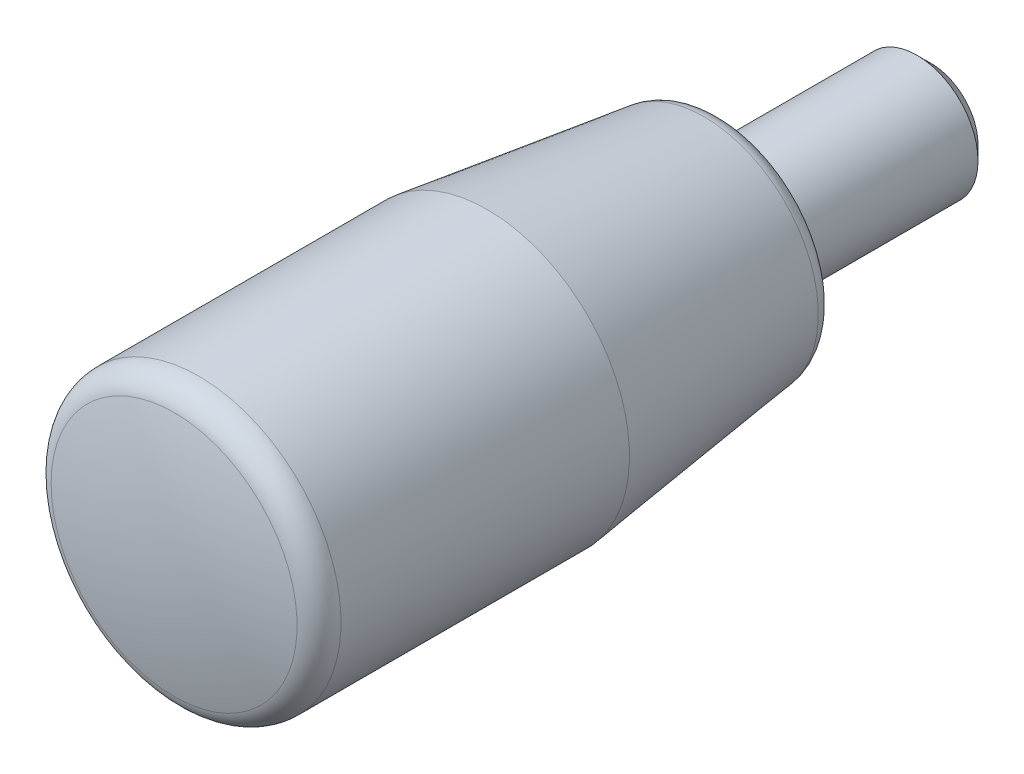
ISO-10303-21;
HEADER;
FILE_DESCRIPTION(('STEP AP214'),'2;1');
FILE_NAME('part.step','',(''),(''),'','','');
FILE_SCHEMA(('AUTOMOTIVE_DESIGN { 1 0 10303 214 1 1 1 1 }'));
ENDSEC;
DATA;
#1=APPLICATION_CONTEXT('core data for automotive mechanical design processes');
#2=APPLICATION_PROTOCOL_DEFINITION('international standard','automotive_design',2000,#1);
#3=PRODUCT_CONTEXT('',#1,'mechanical');
#4=PRODUCT('Part','Part','',(#3));
#5=PRODUCT_RELATED_PRODUCT_CATEGORY('part','',(#4));
#6=PRODUCT_DEFINITION_FORMATION('','',#4);
#7=PRODUCT_DEFINITION_CONTEXT('part definition',#1,'design');
#8=PRODUCT_DEFINITION('design','',#6,#7);
#9=PRODUCT_DEFINITION_SHAPE('','',#8);
#10=(LENGTH_UNIT() NAMED_UNIT(*) SI_UNIT(.MILLI.,.METRE.));
#11=(NAMED_UNIT(*) PLANE_ANGLE_UNIT() SI_UNIT($,.RADIAN.));
#12=(NAMED_UNIT(*) SI_UNIT($,.STERADIAN.) SOLID_ANGLE_UNIT());
#13=UNCERTAINTY_MEASURE_WITH_UNIT(LENGTH_MEASURE(1.E-05),#10,'distance_accuracy_value','');
#14=(GEOMETRIC_REPRESENTATION_CONTEXT(3) GLOBAL_UNCERTAINTY_ASSIGNED_CONTEXT((#13)) GLOBAL_UNIT_ASSIGNED_CONTEXT((#10,
#11,#12)) REPRESENTATION_CONTEXT('',''));
#15=CARTESIAN_POINT('',(0.,0.,0.));
#16=DIRECTION('',(0.,0.,1.));
#17=DIRECTION('',(1.,0.,0.));
#18=AXIS2_PLACEMENT_3D('',#15,#16,#17);
#19=CARTESIAN_POINT('',(0.,0.,1.3));
#20=DIRECTION('',(0.,0.,-1.));
#21=DIRECTION('',(-1.,0.,0.));
#22=AXIS2_PLACEMENT_3D('',#19,#20,#21);
#23=TOROIDAL_SURFACE('',#22,4.62147853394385,1.00000000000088);
#24=CARTESIAN_POINT('',(0.,0.,0.299999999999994));
#25=DIRECTION('',(0.,0.,-1.));
#26=DIRECTION('',(-1.,0.,0.));
#27=AXIS2_PLACEMENT_3D('',#24,#25,#26);
#28=CIRCLE('',#27,4.62147853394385);
#29=CARTESIAN_POINT('',(-4.62147853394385,0.,0.299999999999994));
#30=VERTEX_POINT('',#29);
#31=EDGE_CURVE('E142',#30,#30,#28,.T.);
#32=ORIENTED_EDGE('',*,*,#31,.F.);
#33=EDGE_LOOP('',(#32));
#34=FACE_BOUND('',#33,.T.);
#35=CARTESIAN_POINT('',(0.,0.,1.17120252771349));
#36=DIRECTION('',(0.,0.,-1.));
#37=DIRECTION('',(-1.,0.,0.));
#38=AXIS2_PLACEMENT_3D('',#35,#36,#37);
#39=CIRCLE('',#38,5.61314945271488);
#40=CARTESIAN_POINT('',(-5.61314945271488,0.,1.17120252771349));
#41=VERTEX_POINT('',#40);
#42=EDGE_CURVE('E116',#41,#41,#39,.T.);
#43=ORIENTED_EDGE('',*,*,#42,.T.);
#44=EDGE_LOOP('',(#43));
#45=FACE_BOUND('',#44,.T.);
#46=ADVANCED_FACE('F14',(#34,#45),#23,.T.);
#47=CARTESIAN_POINT('',(0.,4.,0.299999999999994));
#48=DIRECTION('',(0.,0.,-1.));
#49=DIRECTION('',(-1.,0.,0.));
#50=AXIS2_PLACEMENT_3D('',#47,#48,#49);
#51=PLANE('',#50);
#52=ORIENTED_EDGE('',*,*,#31,.T.);
#53=EDGE_LOOP('',(#52));
#54=FACE_BOUND('',#53,.T.);
#55=CARTESIAN_POINT('',(0.,0.,0.299999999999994));
#56=DIRECTION('',(0.,0.,-1.));
#57=DIRECTION('',(-1.,0.,0.));
#58=AXIS2_PLACEMENT_3D('',#55,#56,#57);
#59=CIRCLE('',#58,4.);
#60=CARTESIAN_POINT('',(-4.,0.,0.299999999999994));
#61=VERTEX_POINT('',#60);
#62=EDGE_CURVE('E139',#61,#61,#59,.T.);
#63=ORIENTED_EDGE('',*,*,#62,.F.);
#64=EDGE_LOOP('',(#63));
#65=FACE_BOUND('',#64,.T.);
#66=ADVANCED_FACE('F165',(#54,#65),#51,.T.);
#67=CARTESIAN_POINT('',(0.,0.,-14.7));
#68=DIRECTION('',(0.,0.,-1.));
#69=DIRECTION('',(-1.,0.,0.));
#70=AXIS2_PLACEMENT_3D('',#67,#68,#69);
#71=CYLINDRICAL_SURFACE('',#70,4.);
#72=ORIENTED_EDGE('',*,*,#62,.T.);
#73=EDGE_LOOP('',(#72));
#74=FACE_BOUND('',#73,.T.);
#75=CARTESIAN_POINT('',(0.,0.,0.));
#76=DIRECTION('',(0.,0.,-1.));
#77=DIRECTION('',(-1.,0.,0.));
#78=AXIS2_PLACEMENT_3D('',#75,#76,#77);
#79=CIRCLE('',#78,4.);
#80=CARTESIAN_POINT('',(-4.,0.,0.));
#81=VERTEX_POINT('',#80);
#82=EDGE_CURVE('E136',#81,#81,#79,.T.);
#83=ORIENTED_EDGE('',*,*,#82,.F.);
#84=EDGE_LOOP('',(#83));
#85=FACE_BOUND('',#84,.T.);
#86=ADVANCED_FACE('F171',(#74,#85),#71,.T.);
#87=CARTESIAN_POINT('',(0.,4.,0.));
#88=DIRECTION('',(0.,0.,1.));
#89=DIRECTION('',(1.,0.,0.));
#90=AXIS2_PLACEMENT_3D('',#87,#88,#89);
#91=PLANE('',#90);
#92=CARTESIAN_POINT('',(0.,0.,0.));
#93=DIRECTION('',(0.,0.,-1.));
#94=DIRECTION('',(-1.,0.,0.));
#95=AXIS2_PLACEMENT_3D('',#92,#93,#94);
#96=CIRCLE('',#95,3.);
#97=CARTESIAN_POINT('',(-3.,0.,0.));
#98=VERTEX_POINT('',#97);
#99=EDGE_CURVE('E133',#98,#98,#96,.T.);
#100=ORIENTED_EDGE('',*,*,#99,.F.);
#101=EDGE_LOOP('',(#100));
#102=FACE_BOUND('',#101,.T.);
#103=ORIENTED_EDGE('',*,*,#82,.T.);
#104=EDGE_LOOP('',(#103));
#105=FACE_BOUND('',#104,.T.);
#106=ADVANCED_FACE('F179',(#102,#105),#91,.F.);
#107=CARTESIAN_POINT('',(0.,0.,-14.7));
#108=DIRECTION('',(0.,0.,-1.));
#109=DIRECTION('',(-1.,0.,0.));
#110=AXIS2_PLACEMENT_3D('',#107,#108,#109);
#111=CYLINDRICAL_SURFACE('',#110,3.);
#112=CARTESIAN_POINT('',(0.,0.,-9.3));
#113=DIRECTION('',(0.,0.,1.));
#114=DIRECTION('',(1.,0.,0.));
#115=AXIS2_PLACEMENT_3D('',#112,#113,#114);
#116=CIRCLE('',#115,3.);
#117=CARTESIAN_POINT('',(3.,0.,-9.3));
#118=VERTEX_POINT('',#117);
#119=EDGE_CURVE('E9',#118,#118,#116,.T.);
#120=ORIENTED_EDGE('',*,*,#119,.T.);
#121=EDGE_LOOP('',(#120));
#122=FACE_BOUND('',#121,.T.);
#123=ORIENTED_EDGE('',*,*,#99,.T.);
#124=EDGE_LOOP('',(#123));
#125=FACE_BOUND('',#124,.T.);
#126=ADVANCED_FACE('F183',(#122,#125),#111,.T.);
#127=CARTESIAN_POINT('',(0.,0.,3.));
#128=DIRECTION('',(-1.,0.,0.));
#129=DIRECTION('',(0.,0.,1.));
#130=AXIS2_PLACEMENT_3D('',#127,#128,#129);
#131=SPHERICAL_SURFACE('',#130,25.);
#132=CARTESIAN_POINT('',(0.,0.,3.));
#133=DIRECTION('',(0.,0.,-1.));
#134=DIRECTION('',(-1.,0.,0.));
#135=AXIS2_PLACEMENT_3D('',#132,#133,#134);
#136=SPHERICAL_SURFACE('',#135,25.);
#137=CARTESIAN_POINT('',(0.,0.,27.2562497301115));
#138=DIRECTION('',(0.,0.,-1.));
#139=DIRECTION('',(-1.,0.,0.));
#140=AXIS2_PLACEMENT_3D('',#137,#138,#139);
#141=CIRCLE('',#140,6.05263157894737);
#142=CARTESIAN_POINT('',(-6.05263157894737,0.,27.2562497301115));
#143=VERTEX_POINT('',#142);
#144=EDGE_CURVE('E130',#143,#143,#141,.T.);
#145=ORIENTED_EDGE('',*,*,#144,.F.);
#146=EDGE_LOOP('',(#145));
#147=FACE_BOUND('',#146,.T.);
#148=ADVANCED_FACE('F186',(#147),#136,.T.);
#149=CARTESIAN_POINT('',(0.,0.,26.043437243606));
#150=DIRECTION('',(0.,0.,-1.));
#151=DIRECTION('',(-1.,0.,0.));
#152=AXIS2_PLACEMENT_3D('',#149,#150,#151);
#153=TOROIDAL_SURFACE('',#152,5.75,1.24999999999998);
#154=CARTESIAN_POINT('',(0.,0.,26.043437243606));
#155=DIRECTION('',(0.,0.,-1.));
#156=DIRECTION('',(-1.,0.,0.));
#157=AXIS2_PLACEMENT_3D('',#154,#155,#156);
#158=CIRCLE('',#157,7.);
#159=CARTESIAN_POINT('',(-7.,0.,26.043437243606));
#160=VERTEX_POINT('',#159);
#161=EDGE_CURVE('E127',#160,#160,#158,.T.);
#162=ORIENTED_EDGE('',*,*,#161,.F.);
#163=EDGE_LOOP('',(#162));
#164=FACE_BOUND('',#163,.T.);
#165=ORIENTED_EDGE('',*,*,#144,.T.);
#166=EDGE_LOOP('',(#165));
#167=FACE_BOUND('',#166,.T.);
#168=ADVANCED_FACE('F191',(#164,#167),#153,.T.);
#169=CARTESIAN_POINT('',(0.,0.,-14.7));
#170=DIRECTION('',(0.,0.,-1.));
#171=DIRECTION('',(-1.,0.,0.));
#172=AXIS2_PLACEMENT_3D('',#169,#170,#171);
#173=CYLINDRICAL_SURFACE('',#172,7.);
#174=CARTESIAN_POINT('',(0.,0.,11.8493602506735));
#175=DIRECTION('',(0.,0.,-1.));
#176=DIRECTION('',(-1.,0.,0.));
#177=AXIS2_PLACEMENT_3D('',#174,#175,#176);
#178=CIRCLE('',#177,7.);
#179=CARTESIAN_POINT('',(-7.,0.,11.8493602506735));
#180=VERTEX_POINT('',#179);
#181=EDGE_CURVE('E124',#180,#180,#178,.T.);
#182=ORIENTED_EDGE('',*,*,#181,.F.);
#183=EDGE_LOOP('',(#182));
#184=FACE_BOUND('',#183,.T.);
#185=ORIENTED_EDGE('',*,*,#161,.T.);
#186=EDGE_LOOP('',(#185));
#187=FACE_BOUND('',#186,.T.);
#188=ADVANCED_FACE('F195',(#184,#187),#173,.T.);
#189=CARTESIAN_POINT('',(0.,0.,1.17120252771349));
#190=DIRECTION('',(0.,0.,1.));
#191=DIRECTION('',(1.,0.,0.));
#192=AXIS2_PLACEMENT_3D('',#189,#190,#191);
#193=CONICAL_SURFACE('',#192,5.61314945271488,0.129154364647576);
#194=ORIENTED_EDGE('',*,*,#181,.T.);
#195=EDGE_LOOP('',(#194));
#196=FACE_BOUND('',#195,.T.);
#197=ORIENTED_EDGE('',*,*,#42,.F.);
#198=EDGE_LOOP('',(#197));
#199=FACE_BOUND('',#198,.T.);
#200=ADVANCED_FACE('F160',(#196,#199),#193,.T.);
#201=CARTESIAN_POINT('',(0.,3.,-10.));
#202=DIRECTION('',(0.,0.,1.));
#203=DIRECTION('',(1.,0.,0.));
#204=AXIS2_PLACEMENT_3D('',#201,#202,#203);
#205=PLANE('',#204);
#206=DIRECTION('',(0.866025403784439,-0.5,0.));
#207=VECTOR('',#206,1.);
#208=CARTESIAN_POINT('',(0.,1.73205080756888,-10.));
#209=LINE('',#208,#207);
#210=CARTESIAN_POINT('',(0.,1.73205080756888,-10.));
#211=VERTEX_POINT('',#210);
#212=CARTESIAN_POINT('',(1.5,0.86602540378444,-10.));
#213=VERTEX_POINT('',#212);
#214=EDGE_CURVE('E103',#211,#213,#209,.T.);
#215=ORIENTED_EDGE('',*,*,#214,.F.);
#216=DIRECTION('',(0.866025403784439,0.5,0.));
#217=VECTOR('',#216,1.);
#218=CARTESIAN_POINT('',(-1.5,0.86602540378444,-10.));
#219=LINE('',#218,#217);
#220=CARTESIAN_POINT('',(-1.5,0.86602540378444,-10.));
#221=VERTEX_POINT('',#220);
#222=EDGE_CURVE('E29',#221,#211,#219,.T.);
#223=ORIENTED_EDGE('',*,*,#222,.F.);
#224=DIRECTION('',(0.,1.,0.));
#225=VECTOR('',#224,1.);
#226=CARTESIAN_POINT('',(-1.5,-0.866025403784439,-10.));
#227=LINE('',#226,#225);
#228=CARTESIAN_POINT('',(-1.5,-0.866025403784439,-10.));
#229=VERTEX_POINT('',#228);
#230=EDGE_CURVE('E112',#229,#221,#227,.T.);
#231=ORIENTED_EDGE('',*,*,#230,.F.);
#232=DIRECTION('',(-0.866025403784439,0.5,0.));
#233=VECTOR('',#232,1.);
#234=CARTESIAN_POINT('',(0.,-1.73205080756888,-10.));
#235=LINE('',#234,#233);
#236=CARTESIAN_POINT('',(0.,-1.73205080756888,-10.));
#237=VERTEX_POINT('',#236);
#238=EDGE_CURVE('E110',#237,#229,#235,.T.);
#239=ORIENTED_EDGE('',*,*,#238,.F.);
#240=DIRECTION('',(-0.866025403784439,-0.5,0.));
#241=VECTOR('',#240,1.);
#242=CARTESIAN_POINT('',(1.5,-0.866025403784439,-10.));
#243=LINE('',#242,#241);
#244=CARTESIAN_POINT('',(1.5,-0.866025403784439,-10.));
#245=VERTEX_POINT('',#244);
#246=EDGE_CURVE('E77',#245,#237,#243,.T.);
#247=ORIENTED_EDGE('',*,*,#246,.F.);
#248=DIRECTION('',(0.,-1.,0.));
#249=VECTOR('',#248,1.);
#250=CARTESIAN_POINT('',(1.5,0.86602540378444,-10.));
#251=LINE('',#250,#249);
#252=EDGE_CURVE('E106',#213,#245,#251,.T.);
#253=ORIENTED_EDGE('',*,*,#252,.F.);
#254=EDGE_LOOP('',(#215,#223,#231,#239,#247,#253));
#255=FACE_BOUND('',#254,.T.);
#256=CARTESIAN_POINT('',(0.,0.,-10.));
#257=DIRECTION('',(0.,0.,1.));
#258=DIRECTION('',(1.,0.,0.));
#259=AXIS2_PLACEMENT_3D('',#256,#257,#258);
#260=CIRCLE('',#259,2.3);
#261=CARTESIAN_POINT('',(2.3,0.,-10.));
#262=VERTEX_POINT('',#261);
#263=EDGE_CURVE('E22',#262,#262,#260,.F.);
#264=ORIENTED_EDGE('',*,*,#263,.T.);
#265=EDGE_LOOP('',(#264));
#266=FACE_BOUND('',#265,.T.);
#267=ADVANCED_FACE('F147',(#255,#266),#205,.F.);
#268=CARTESIAN_POINT('',(0.,0.,-10.));
#269=DIRECTION('',(0.,0.,1.));
#270=DIRECTION('',(1.,0.,0.));
#271=AXIS2_PLACEMENT_3D('',#268,#269,#270);
#272=CONICAL_SURFACE('',#271,2.3,0.785398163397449);
#273=ORIENTED_EDGE('',*,*,#119,.F.);
#274=EDGE_LOOP('',(#273));
#275=FACE_BOUND('',#274,.T.);
#276=ORIENTED_EDGE('',*,*,#263,.F.);
#277=EDGE_LOOP('',(#276));
#278=FACE_BOUND('',#277,.T.);
#279=ADVANCED_FACE('F16',(#275,#278),#272,.T.);
#280=CARTESIAN_POINT('',(-1.5,0.86602540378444,-6.));
#281=DIRECTION('',(-0.5,0.866025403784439,0.));
#282=DIRECTION('',(-0.866025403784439,-0.5,0.));
#283=AXIS2_PLACEMENT_3D('',#280,#281,#282);
#284=PLANE('',#283);
#285=ORIENTED_EDGE('',*,*,#222,.T.);
#286=DIRECTION('',(0.,0.,-1.));
#287=VECTOR('',#286,1.);
#288=CARTESIAN_POINT('',(0.,1.73205080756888,-6.));
#289=LINE('',#288,#287);
#290=CARTESIAN_POINT('',(0.,1.73205080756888,-6.));
#291=VERTEX_POINT('',#290);
#292=EDGE_CURVE('E59',#291,#211,#289,.T.);
#293=ORIENTED_EDGE('',*,*,#292,.F.);
#294=DIRECTION('',(0.866025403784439,0.5,0.));
#295=VECTOR('',#294,1.);
#296=CARTESIAN_POINT('',(-1.5,0.86602540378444,-6.));
#297=LINE('',#296,#295);
#298=CARTESIAN_POINT('',(-1.5,0.86602540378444,-6.));
#299=VERTEX_POINT('',#298);
#300=EDGE_CURVE('E114',#299,#291,#297,.T.);
#301=ORIENTED_EDGE('',*,*,#300,.F.);
#302=DIRECTION('',(0.,0.,-1.));
#303=VECTOR('',#302,1.);
#304=CARTESIAN_POINT('',(-1.5,0.86602540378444,-6.));
#305=LINE('',#304,#303);
#306=EDGE_CURVE('E37',#299,#221,#305,.T.);
#307=ORIENTED_EDGE('',*,*,#306,.T.);
#308=EDGE_LOOP('',(#285,#293,#301,#307));
#309=FACE_BOUND('',#308,.T.);
#310=ADVANCED_FACE('F150',(#309),#284,.F.);
#311=CARTESIAN_POINT('',(-1.5,-0.866025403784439,-6.));
#312=DIRECTION('',(-1.,0.,0.));
#313=DIRECTION('',(0.,0.,1.));
#314=AXIS2_PLACEMENT_3D('',#311,#312,#313);
#315=PLANE('',#314);
#316=ORIENTED_EDGE('',*,*,#230,.T.);
#317=ORIENTED_EDGE('',*,*,#306,.F.);
#318=DIRECTION('',(0.,1.,0.));
#319=VECTOR('',#318,1.);
#320=CARTESIAN_POINT('',(-1.5,-0.866025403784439,-6.));
#321=LINE('',#320,#319);
#322=CARTESIAN_POINT('',(-1.5,-0.866025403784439,-6.));
#323=VERTEX_POINT('',#322);
#324=EDGE_CURVE('E89',#323,#299,#321,.T.);
#325=ORIENTED_EDGE('',*,*,#324,.F.);
#326=DIRECTION('',(0.,0.,-1.));
#327=VECTOR('',#326,1.);
#328=CARTESIAN_POINT('',(-1.5,-0.866025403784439,-6.));
#329=LINE('',#328,#327);
#330=EDGE_CURVE('E81',#323,#229,#329,.T.);
#331=ORIENTED_EDGE('',*,*,#330,.T.);
#332=EDGE_LOOP('',(#316,#317,#325,#331));
#333=FACE_BOUND('',#332,.T.);
#334=ADVANCED_FACE('F158',(#333),#315,.F.);
#335=CARTESIAN_POINT('',(0.,-1.73205080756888,-6.));
#336=DIRECTION('',(-0.5,-0.866025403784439,0.));
#337=DIRECTION('',(0.866025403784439,-0.5,0.));
#338=AXIS2_PLACEMENT_3D('',#335,#336,#337);
#339=PLANE('',#338);
#340=ORIENTED_EDGE('',*,*,#238,.T.);
#341=ORIENTED_EDGE('',*,*,#330,.F.);
#342=DIRECTION('',(-0.866025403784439,0.5,0.));
#343=VECTOR('',#342,1.);
#344=CARTESIAN_POINT('',(0.,-1.73205080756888,-6.));
#345=LINE('',#344,#343);
#346=CARTESIAN_POINT('',(0.,-1.73205080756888,-6.));
#347=VERTEX_POINT('',#346);
#348=EDGE_CURVE('E85',#347,#323,#345,.T.);
#349=ORIENTED_EDGE('',*,*,#348,.F.);
#350=DIRECTION('',(0.,0.,-1.));
#351=VECTOR('',#350,1.);
#352=CARTESIAN_POINT('',(0.,-1.73205080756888,-6.));
#353=LINE('',#352,#351);
#354=EDGE_CURVE('E70',#347,#237,#353,.T.);
#355=ORIENTED_EDGE('',*,*,#354,.T.);
#356=EDGE_LOOP('',(#340,#341,#349,#355));
#357=FACE_BOUND('',#356,.T.);
#358=ADVANCED_FACE('F86',(#357),#339,.F.);
#359=CARTESIAN_POINT('',(1.5,-0.866025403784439,-6.));
#360=DIRECTION('',(0.5,-0.866025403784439,0.));
#361=DIRECTION('',(0.866025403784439,0.5,0.));
#362=AXIS2_PLACEMENT_3D('',#359,#360,#361);
#363=PLANE('',#362);
#364=ORIENTED_EDGE('',*,*,#246,.T.);
#365=ORIENTED_EDGE('',*,*,#354,.F.);
#366=DIRECTION('',(-0.866025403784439,-0.5,0.));
#367=VECTOR('',#366,1.);
#368=CARTESIAN_POINT('',(1.5,-0.866025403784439,-6.));
#369=LINE('',#368,#367);
#370=CARTESIAN_POINT('',(1.5,-0.866025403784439,-6.));
#371=VERTEX_POINT('',#370);
#372=EDGE_CURVE('E74',#371,#347,#369,.T.);
#373=ORIENTED_EDGE('',*,*,#372,.F.);
#374=DIRECTION('',(0.,0.,-1.));
#375=VECTOR('',#374,1.);
#376=CARTESIAN_POINT('',(1.5,-0.866025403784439,-6.));
#377=LINE('',#376,#375);
#378=EDGE_CURVE('E82',#371,#245,#377,.T.);
#379=ORIENTED_EDGE('',*,*,#378,.T.);
#380=EDGE_LOOP('',(#364,#365,#373,#379));
#381=FACE_BOUND('',#380,.T.);
#382=ADVANCED_FACE('F72',(#381),#363,.F.);
#383=CARTESIAN_POINT('',(1.5,0.86602540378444,-6.));
#384=DIRECTION('',(1.,0.,0.));
#385=DIRECTION('',(0.,1.,0.));
#386=AXIS2_PLACEMENT_3D('',#383,#384,#385);
#387=PLANE('',#386);
#388=ORIENTED_EDGE('',*,*,#252,.T.);
#389=ORIENTED_EDGE('',*,*,#378,.F.);
#390=DIRECTION('',(0.,-1.,0.));
#391=VECTOR('',#390,1.);
#392=CARTESIAN_POINT('',(1.5,0.86602540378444,-6.));
#393=LINE('',#392,#391);
#394=CARTESIAN_POINT('',(1.5,0.86602540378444,-6.));
#395=VERTEX_POINT('',#394);
#396=EDGE_CURVE('E95',#395,#371,#393,.T.);
#397=ORIENTED_EDGE('',*,*,#396,.F.);
#398=DIRECTION('',(0.,0.,-1.));
#399=VECTOR('',#398,1.);
#400=CARTESIAN_POINT('',(1.5,0.86602540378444,-6.));
#401=LINE('',#400,#399);
#402=EDGE_CURVE('E119',#395,#213,#401,.T.);
#403=ORIENTED_EDGE('',*,*,#402,.T.);
#404=EDGE_LOOP('',(#388,#389,#397,#403));
#405=FACE_BOUND('',#404,.T.);
#406=ADVANCED_FACE('F206',(#405),#387,.F.);
#407=CARTESIAN_POINT('',(0.,1.73205080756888,-6.));
#408=DIRECTION('',(0.5,0.866025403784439,0.));
#409=DIRECTION('',(-0.866025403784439,0.5,0.));
#410=AXIS2_PLACEMENT_3D('',#407,#408,#409);
#411=PLANE('',#410);
#412=ORIENTED_EDGE('',*,*,#214,.T.);
#413=ORIENTED_EDGE('',*,*,#402,.F.);
#414=DIRECTION('',(0.866025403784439,-0.5,0.));
#415=VECTOR('',#414,1.);
#416=CARTESIAN_POINT('',(0.,1.73205080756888,-6.));
#417=LINE('',#416,#415);
#418=EDGE_CURVE('E97',#291,#395,#417,.T.);
#419=ORIENTED_EDGE('',*,*,#418,.F.);
#420=ORIENTED_EDGE('',*,*,#292,.T.);
#421=EDGE_LOOP('',(#412,#413,#419,#420));
#422=FACE_BOUND('',#421,.T.);
#423=ADVANCED_FACE('F203',(#422),#411,.F.);
#424=CARTESIAN_POINT('',(0.,1.73205080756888,-6.));
#425=DIRECTION('',(0.,0.,-1.));
#426=DIRECTION('',(-1.,0.,0.));
#427=AXIS2_PLACEMENT_3D('',#424,#425,#426);
#428=PLANE('',#427);
#429=ORIENTED_EDGE('',*,*,#300,.T.);
#430=ORIENTED_EDGE('',*,*,#418,.T.);
#431=ORIENTED_EDGE('',*,*,#396,.T.);
#432=ORIENTED_EDGE('',*,*,#372,.T.);
#433=ORIENTED_EDGE('',*,*,#348,.T.);
#434=ORIENTED_EDGE('',*,*,#324,.T.);
#435=EDGE_LOOP('',(#429,#430,#431,#432,#433,#434));
#436=FACE_BOUND('',#435,.T.);
#437=ADVANCED_FACE('F92',(#436),#428,.T.);
#438=CLOSED_SHELL('',(#46,#66,#86,#106,#126,#148,#168,#188,#200,#267,#279,#310,#334,#358,#382,
#406,#423,#437));
#439=MANIFOLD_SOLID_BREP('B1',#438);
#440=ADVANCED_BREP_SHAPE_REPRESENTATION('',(#18,#439),#14);
#441=SHAPE_DEFINITION_REPRESENTATION(#9,#440);
ENDSEC;
END-ISO-10303-21;
